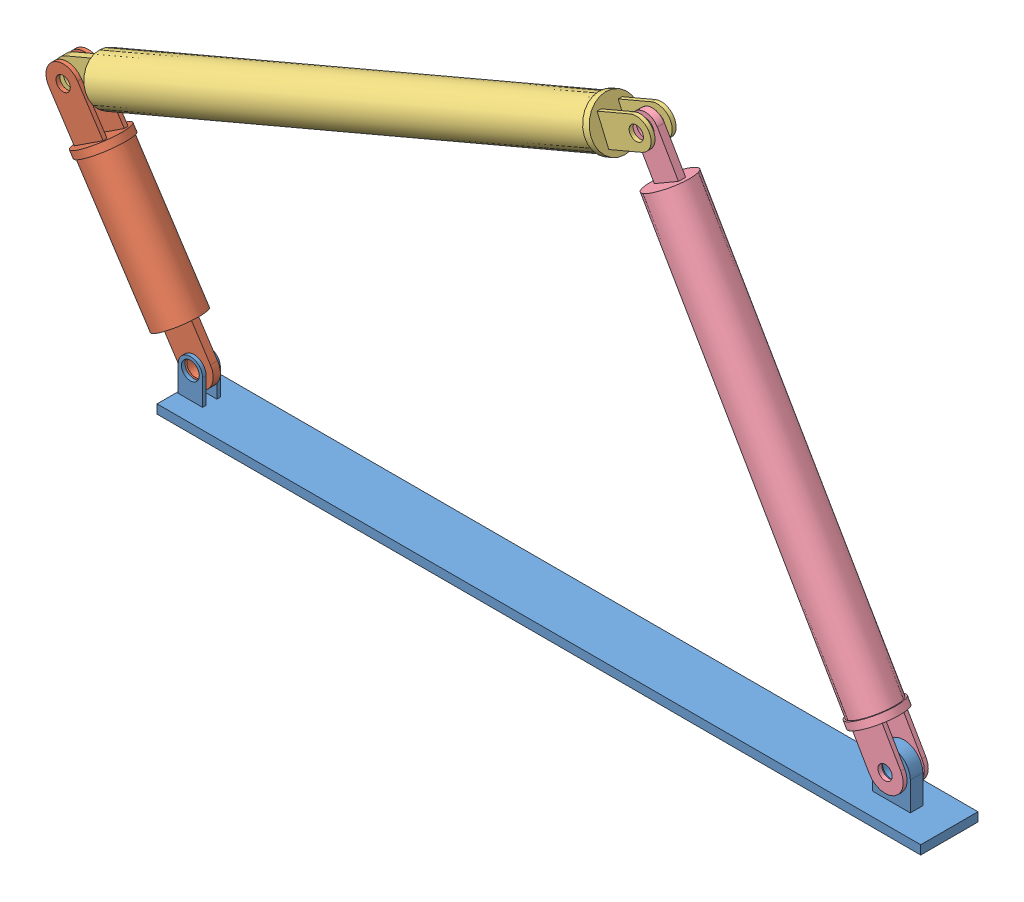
SolidWorks assembly 4Bar.SLDASM, configuration Default (file format 4400). Lengths in mm.
Overall size (504.92 276.72 32).
4 component instances, 4 part files, 7 mates.
Components (placement in the parent):
- Base-1: Base.SLDPRT [Default] at (-234.1609 0 0) size (426.72 31.61 32)
- Link2-1: Link2.SLDPRT [Link1] at (-237.368 33.4213 0) x (-0.5485 0.836151 0) z (0 0 1) size (145.37 27.4 27.4)
- Link1-1: Link1.SLDPRT [Link1] at (-277.4585 129.9408 0) x (0.920291 0.391235 0) z (0 0 1) size (366.1 27.4 27.4)
- Link3-1: Link3.SLDPRT [Link1] at (36.4647 237.9199 0) x (0.501499 -0.865158 0) z (0 0 1) size (295.14 27.4 27.4)
Mates (geometry in assembly coordinates):
- Concentric1: concentric aligned: cylinder of Base-1 through (-226.5444 16.9215 5) axis (0 0 -1) radius 5; cylinder of Link2-1 through (-226.5444 16.9215 2) axis (0 0 -1) radius 5
- Coincident3: coincident aligned: plane of assembly through (-234.1609 0 0) normal (0 0 1)
- Concentric2: concentric aligned: cylinder of Link2-1 through (-295.6187 122.2205 7) axis (0 0 -1) radius 4; cylinder of Link1-1 through (-295.6187 122.2205 2) axis (0 0 -1) radius 5
- Coincident4: coincident aligned: plane of Link1-1; plane of assembly through (-277.4585 129.9408 0) normal (0 0 1)
- Concentric3: concentric aligned: cylinder of Link1-1 through (24.6167 258.3594 7) axis (0 0 -1) radius 4; cylinder of Link3-1 through (24.6167 258.3594 2) axis (0 0 -1) radius 5
- Coincident5: coincident aligned: plane of Link3-1; plane of assembly through (36.4647 237.9199 0) normal (0 0 1)
- Concentric4: concentric aligned: cylinder of Base-1 through (163.6447 18.5157 3.5) axis (0 0 -1) radius 5; cylinder of Link3-1 through (163.6447 18.5157 7) axis (0 0 -1) radius 4
